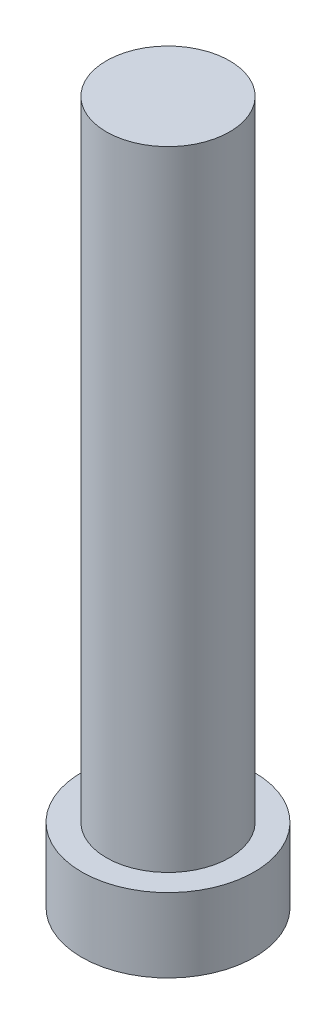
ISO-10303-21;
HEADER;
FILE_DESCRIPTION(('STEP AP214'),'2;1');
FILE_NAME('part.step','',(''),(''),'','','');
FILE_SCHEMA(('AUTOMOTIVE_DESIGN { 1 0 10303 214 1 1 1 1 }'));
ENDSEC;
DATA;
#1=APPLICATION_CONTEXT('core data for automotive mechanical design processes');
#2=APPLICATION_PROTOCOL_DEFINITION('international standard','automotive_design',2000,#1);
#3=PRODUCT_CONTEXT('',#1,'mechanical');
#4=PRODUCT('Part','Part','',(#3));
#5=PRODUCT_RELATED_PRODUCT_CATEGORY('part','',(#4));
#6=PRODUCT_DEFINITION_FORMATION('','',#4);
#7=PRODUCT_DEFINITION_CONTEXT('part definition',#1,'design');
#8=PRODUCT_DEFINITION('design','',#6,#7);
#9=PRODUCT_DEFINITION_SHAPE('','',#8);
#10=(LENGTH_UNIT() NAMED_UNIT(*) SI_UNIT(.MILLI.,.METRE.));
#11=(NAMED_UNIT(*) PLANE_ANGLE_UNIT() SI_UNIT($,.RADIAN.));
#12=(NAMED_UNIT(*) SI_UNIT($,.STERADIAN.) SOLID_ANGLE_UNIT());
#13=UNCERTAINTY_MEASURE_WITH_UNIT(LENGTH_MEASURE(1.E-05),#10,'distance_accuracy_value','');
#14=(GEOMETRIC_REPRESENTATION_CONTEXT(3) GLOBAL_UNCERTAINTY_ASSIGNED_CONTEXT((#13)) GLOBAL_UNIT_ASSIGNED_CONTEXT((#10,
#11,#12)) REPRESENTATION_CONTEXT('',''));
#15=CARTESIAN_POINT('',(0.,0.,0.));
#16=DIRECTION('',(0.,0.,1.));
#17=DIRECTION('',(1.,0.,0.));
#18=AXIS2_PLACEMENT_3D('',#15,#16,#17);
#19=CARTESIAN_POINT('',(0.,49.4323076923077,0.));
#20=DIRECTION('',(0.,1.,0.));
#21=DIRECTION('',(0.,0.,1.));
#22=AXIS2_PLACEMENT_3D('',#19,#20,#21);
#23=CYLINDRICAL_SURFACE('',#22,4.99999999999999);
#24=CARTESIAN_POINT('',(0.,6.,0.));
#25=DIRECTION('',(0.,1.,0.));
#26=DIRECTION('',(0.,0.,1.));
#27=AXIS2_PLACEMENT_3D('',#24,#25,#26);
#28=CIRCLE('',#27,4.99999999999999);
#29=CARTESIAN_POINT('',(0.,6.,4.99999999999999));
#30=VERTEX_POINT('',#29);
#31=EDGE_CURVE('E10',#30,#30,#28,.T.);
#32=ORIENTED_EDGE('',*,*,#31,.T.);
#33=EDGE_LOOP('',(#32));
#34=FACE_BOUND('',#33,.T.);
#35=CARTESIAN_POINT('',(0.,57.,0.));
#36=DIRECTION('',(0.,1.,0.));
#37=DIRECTION('',(0.,0.,1.));
#38=AXIS2_PLACEMENT_3D('',#35,#36,#37);
#39=CIRCLE('',#38,4.99999999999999);
#40=CARTESIAN_POINT('',(0.,57.,4.99999999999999));
#41=VERTEX_POINT('',#40);
#42=EDGE_CURVE('E45',#41,#41,#39,.T.);
#43=ORIENTED_EDGE('',*,*,#42,.F.);
#44=EDGE_LOOP('',(#43));
#45=FACE_BOUND('',#44,.T.);
#46=ADVANCED_FACE('F31',(#34,#45),#23,.T.);
#47=CARTESIAN_POINT('',(-7.,6.,0.));
#48=DIRECTION('',(0.,1.,0.));
#49=DIRECTION('',(0.,0.,1.));
#50=AXIS2_PLACEMENT_3D('',#47,#48,#49);
#51=PLANE('',#50);
#52=CARTESIAN_POINT('',(0.,6.,0.));
#53=DIRECTION('',(0.,1.,0.));
#54=DIRECTION('',(0.,0.,1.));
#55=AXIS2_PLACEMENT_3D('',#52,#53,#54);
#56=CIRCLE('',#55,7.);
#57=CARTESIAN_POINT('',(0.,6.,7.));
#58=VERTEX_POINT('',#57);
#59=EDGE_CURVE('E37',#58,#58,#56,.T.);
#60=ORIENTED_EDGE('',*,*,#59,.T.);
#61=EDGE_LOOP('',(#60));
#62=FACE_BOUND('',#61,.T.);
#63=ORIENTED_EDGE('',*,*,#31,.F.);
#64=EDGE_LOOP('',(#63));
#65=FACE_BOUND('',#64,.T.);
#66=ADVANCED_FACE('F54',(#62,#65),#51,.T.);
#67=CARTESIAN_POINT('',(0.,49.4323076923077,0.));
#68=DIRECTION('',(0.,1.,0.));
#69=DIRECTION('',(0.,0.,1.));
#70=AXIS2_PLACEMENT_3D('',#67,#68,#69);
#71=CYLINDRICAL_SURFACE('',#70,7.);
#72=CARTESIAN_POINT('',(0.,0.,0.));
#73=DIRECTION('',(0.,1.,0.));
#74=DIRECTION('',(0.,0.,1.));
#75=AXIS2_PLACEMENT_3D('',#72,#73,#74);
#76=CIRCLE('',#75,6.99999999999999);
#77=CARTESIAN_POINT('',(0.,0.,6.99999999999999));
#78=VERTEX_POINT('',#77);
#79=EDGE_CURVE('E41',#78,#78,#76,.T.);
#80=ORIENTED_EDGE('',*,*,#79,.T.);
#81=EDGE_LOOP('',(#80));
#82=FACE_BOUND('',#81,.T.);
#83=ORIENTED_EDGE('',*,*,#59,.F.);
#84=EDGE_LOOP('',(#83));
#85=FACE_BOUND('',#84,.T.);
#86=ADVANCED_FACE('F58',(#82,#85),#71,.T.);
#87=CARTESIAN_POINT('',(0.,0.,0.));
#88=DIRECTION('',(0.,-1.,0.));
#89=DIRECTION('',(0.,0.,-1.));
#90=AXIS2_PLACEMENT_3D('',#87,#88,#89);
#91=PLANE('',#90);
#92=ORIENTED_EDGE('',*,*,#79,.F.);
#93=EDGE_LOOP('',(#92));
#94=FACE_BOUND('',#93,.T.);
#95=ADVANCED_FACE('F62',(#94),#91,.T.);
#96=CARTESIAN_POINT('',(0.,57.,0.));
#97=DIRECTION('',(0.,1.,0.));
#98=DIRECTION('',(0.,0.,1.));
#99=AXIS2_PLACEMENT_3D('',#96,#97,#98);
#100=PLANE('',#99);
#101=ORIENTED_EDGE('',*,*,#42,.T.);
#102=EDGE_LOOP('',(#101));
#103=FACE_BOUND('',#102,.T.);
#104=ADVANCED_FACE('F51',(#103),#100,.T.);
#105=CLOSED_SHELL('',(#46,#66,#86,#95,#104));
#106=MANIFOLD_SOLID_BREP('B2',#105);
#107=ADVANCED_BREP_SHAPE_REPRESENTATION('',(#18,#106),#14);
#108=SHAPE_DEFINITION_REPRESENTATION(#9,#107);
ENDSEC;
END-ISO-10303-21;
